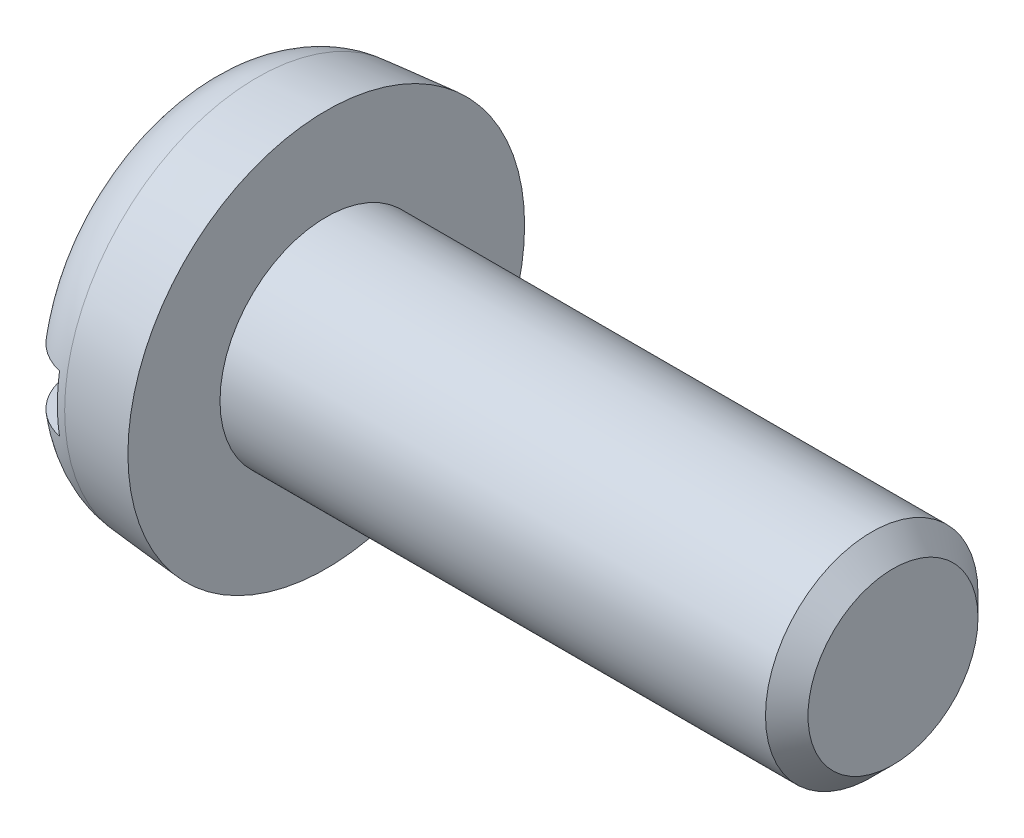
ISO-10303-21;
HEADER;
FILE_DESCRIPTION(('STEP AP214'),'2;1');
FILE_NAME('part.step','',(''),(''),'','','');
FILE_SCHEMA(('AUTOMOTIVE_DESIGN { 1 0 10303 214 1 1 1 1 }'));
ENDSEC;
DATA;
#1=APPLICATION_CONTEXT('core data for automotive mechanical design processes');
#2=APPLICATION_PROTOCOL_DEFINITION('international standard','automotive_design',2000,#1);
#3=PRODUCT_CONTEXT('',#1,'mechanical');
#4=PRODUCT('Part','Part','',(#3));
#5=PRODUCT_RELATED_PRODUCT_CATEGORY('part','',(#4));
#6=PRODUCT_DEFINITION_FORMATION('','',#4);
#7=PRODUCT_DEFINITION_CONTEXT('part definition',#1,'design');
#8=PRODUCT_DEFINITION('design','',#6,#7);
#9=PRODUCT_DEFINITION_SHAPE('','',#8);
#10=(LENGTH_UNIT() NAMED_UNIT(*) SI_UNIT(.MILLI.,.METRE.));
#11=(NAMED_UNIT(*) PLANE_ANGLE_UNIT() SI_UNIT($,.RADIAN.));
#12=(NAMED_UNIT(*) SI_UNIT($,.STERADIAN.) SOLID_ANGLE_UNIT());
#13=UNCERTAINTY_MEASURE_WITH_UNIT(LENGTH_MEASURE(1.E-05),#10,'distance_accuracy_value','');
#14=(GEOMETRIC_REPRESENTATION_CONTEXT(3) GLOBAL_UNCERTAINTY_ASSIGNED_CONTEXT((#13)) GLOBAL_UNIT_ASSIGNED_CONTEXT((#10,
#11,#12)) REPRESENTATION_CONTEXT('',''));
#15=CARTESIAN_POINT('',(0.,0.,0.));
#16=DIRECTION('',(0.,0.,1.));
#17=DIRECTION('',(1.,0.,0.));
#18=AXIS2_PLACEMENT_3D('',#15,#16,#17);
#19=CARTESIAN_POINT('',(0.,0.,0.));
#20=DIRECTION('',(-1.,0.,0.));
#21=DIRECTION('',(0.,0.,1.));
#22=AXIS2_PLACEMENT_3D('',#19,#20,#21);
#23=PLANE('',#22);
#24=DIRECTION('',(0.,0.,-1.));
#25=VECTOR('',#24,1.);
#26=CARTESIAN_POINT('',(0.,0.399999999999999,2.8));
#27=LINE('',#26,#25);
#28=CARTESIAN_POINT('',(0.,0.399999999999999,1.77326763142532));
#29=VERTEX_POINT('',#28);
#30=CARTESIAN_POINT('',(0.,0.399999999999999,-1.77326763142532));
#31=VERTEX_POINT('',#30);
#32=EDGE_CURVE('E84',#29,#31,#27,.T.);
#33=ORIENTED_EDGE('',*,*,#32,.F.);
#34=CARTESIAN_POINT('',(0.,0.,0.));
#35=DIRECTION('',(-1.,0.,0.));
#36=DIRECTION('',(0.,0.,1.));
#37=AXIS2_PLACEMENT_3D('',#34,#35,#36);
#38=CIRCLE('',#37,1.81782234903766);
#39=EDGE_CURVE('E91',#29,#31,#38,.T.);
#40=ORIENTED_EDGE('',*,*,#39,.T.);
#41=EDGE_LOOP('',(#33,#40));
#42=FACE_BOUND('',#41,.T.);
#43=ADVANCED_FACE('F31',(#42),#23,.T.);
#44=CARTESIAN_POINT('',(-25.4,0.,0.));
#45=DIRECTION('',(-1.,0.,0.));
#46=DIRECTION('',(0.,0.,1.));
#47=AXIS2_PLACEMENT_3D('',#44,#45,#46);
#48=CYLINDRICAL_SURFACE('',#47,1.5);
#49=CARTESIAN_POINT('',(9.49999999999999,0.,0.));
#50=DIRECTION('',(1.,0.,0.));
#51=DIRECTION('',(0.,0.,-1.));
#52=AXIS2_PLACEMENT_3D('',#49,#50,#51);
#53=CIRCLE('',#52,1.5);
#54=CARTESIAN_POINT('',(9.49999999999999,0.,-1.5));
#55=VERTEX_POINT('',#54);
#56=EDGE_CURVE('E39',#55,#55,#53,.F.);
#57=ORIENTED_EDGE('',*,*,#56,.T.);
#58=EDGE_LOOP('',(#57));
#59=FACE_BOUND('',#58,.T.);
#60=CARTESIAN_POINT('',(1.8,0.,0.));
#61=DIRECTION('',(-1.,0.,0.));
#62=DIRECTION('',(0.,0.,1.));
#63=AXIS2_PLACEMENT_3D('',#60,#61,#62);
#64=CIRCLE('',#63,1.5);
#65=CARTESIAN_POINT('',(1.8,0.,1.5));
#66=VERTEX_POINT('',#65);
#67=EDGE_CURVE('E97',#66,#66,#64,.T.);
#68=ORIENTED_EDGE('',*,*,#67,.F.);
#69=EDGE_LOOP('',(#68));
#70=FACE_BOUND('',#69,.T.);
#71=ADVANCED_FACE('F33',(#59,#70),#48,.T.);
#72=CARTESIAN_POINT('',(9.8,1.5,0.));
#73=DIRECTION('',(1.,0.,0.));
#74=DIRECTION('',(0.,0.,-1.));
#75=AXIS2_PLACEMENT_3D('',#72,#73,#74);
#76=PLANE('',#75);
#77=CARTESIAN_POINT('',(9.8,0.,0.));
#78=DIRECTION('',(1.,0.,0.));
#79=DIRECTION('',(0.,0.,-1.));
#80=AXIS2_PLACEMENT_3D('',#77,#78,#79);
#81=CIRCLE('',#80,1.19999999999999);
#82=CARTESIAN_POINT('',(9.8,0.,-1.19999999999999));
#83=VERTEX_POINT('',#82);
#84=EDGE_CURVE('E11',#83,#83,#81,.T.);
#85=ORIENTED_EDGE('',*,*,#84,.T.);
#86=EDGE_LOOP('',(#85));
#87=FACE_BOUND('',#86,.T.);
#88=ADVANCED_FACE('F147',(#87),#76,.T.);
#89=DIRECTION('',(0.,0.,1.));
#90=VECTOR('',#89,1.);
#91=CARTESIAN_POINT('',(0.,-0.4,-2.8));
#92=LINE('',#91,#90);
#93=CARTESIAN_POINT('',(0.,-0.4,-1.77326763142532));
#94=VERTEX_POINT('',#93);
#95=CARTESIAN_POINT('',(0.,-0.4,1.77326763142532));
#96=VERTEX_POINT('',#95);
#97=EDGE_CURVE('E73',#94,#96,#92,.T.);
#98=ORIENTED_EDGE('',*,*,#97,.F.);
#99=EDGE_CURVE('E82',#94,#96,#38,.T.);
#100=ORIENTED_EDGE('',*,*,#99,.T.);
#101=EDGE_LOOP('',(#98,#100));
#102=FACE_BOUND('',#101,.T.);
#103=ADVANCED_FACE('F81',(#102),#23,.T.);
#104=CARTESIAN_POINT('',(0.,0.,0.));
#105=DIRECTION('',(1.,0.,0.));
#106=DIRECTION('',(0.,0.,-1.));
#107=AXIS2_PLACEMENT_3D('',#104,#105,#106);
#108=CONICAL_SURFACE('',#107,2.64252040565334,0.087266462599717);
#109=CARTESIAN_POINT('',(0.821559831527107,0.,0.));
#110=DIRECTION('',(-1.,0.,0.));
#111=DIRECTION('',(0.,0.,1.));
#112=AXIS2_PLACEMENT_3D('',#109,#110,#111);
#113=CIRCLE('',#112,2.71439757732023);
#114=CARTESIAN_POINT('',(0.821559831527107,0.,2.71439757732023));
#115=VERTEX_POINT('',#114);
#116=EDGE_CURVE('E95',#115,#115,#113,.F.);
#117=ORIENTED_EDGE('',*,*,#116,.T.);
#118=EDGE_LOOP('',(#117));
#119=FACE_BOUND('',#118,.T.);
#120=CARTESIAN_POINT('',(1.8,0.,0.));
#121=DIRECTION('',(-1.,0.,0.));
#122=DIRECTION('',(0.,0.,1.));
#123=AXIS2_PLACEMENT_3D('',#120,#121,#122);
#124=CIRCLE('',#123,2.8);
#125=CARTESIAN_POINT('',(1.8,0.,2.8));
#126=VERTEX_POINT('',#125);
#127=EDGE_CURVE('E92',#126,#126,#124,.T.);
#128=ORIENTED_EDGE('',*,*,#127,.T.);
#129=EDGE_LOOP('',(#128));
#130=FACE_BOUND('',#129,.T.);
#131=ADVANCED_FACE('F151',(#119,#130),#108,.T.);
#132=CARTESIAN_POINT('',(1.8,1.5,0.));
#133=DIRECTION('',(-1.,0.,0.));
#134=DIRECTION('',(0.,0.,1.));
#135=AXIS2_PLACEMENT_3D('',#132,#133,#134);
#136=PLANE('',#135);
#137=ORIENTED_EDGE('',*,*,#127,.F.);
#138=EDGE_LOOP('',(#137));
#139=FACE_BOUND('',#138,.T.);
#140=ORIENTED_EDGE('',*,*,#67,.T.);
#141=EDGE_LOOP('',(#140));
#142=FACE_BOUND('',#141,.T.);
#143=ADVANCED_FACE('F156',(#139,#142),#136,.F.);
#144=CARTESIAN_POINT('',(0.9,0.,0.));
#145=DIRECTION('',(-1.,0.,0.));
#146=DIRECTION('',(0.,0.,1.));
#147=AXIS2_PLACEMENT_3D('',#144,#145,#146);
#148=TOROIDAL_SURFACE('',#147,1.81782234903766,0.9);
#149=CARTESIAN_POINT('',(0.285780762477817,0.399999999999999,-2.44311963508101));
#150=CARTESIAN_POINT('',(0.322325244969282,0.399999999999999,-2.47769297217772));
#151=CARTESIAN_POINT('',(0.361794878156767,0.399999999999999,-2.50922544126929));
#152=CARTESIAN_POINT('',(0.445493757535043,0.399999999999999,-2.56525291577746));
#153=CARTESIAN_POINT('',(0.48972822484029,0.399999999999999,-2.58974009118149));
#154=CARTESIAN_POINT('',(0.581685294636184,0.399999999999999,-2.63091846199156));
#155=CARTESIAN_POINT('',(0.629407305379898,0.399999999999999,-2.64761097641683));
#156=CARTESIAN_POINT('',(0.726972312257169,0.399999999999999,-2.67270033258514));
#157=CARTESIAN_POINT('',(0.776814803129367,0.399999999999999,-2.68109913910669));
#158=CARTESIAN_POINT('',(0.876977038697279,0.399999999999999,-2.68933922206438));
#159=CARTESIAN_POINT('',(0.92729364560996,0.399999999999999,-2.68921866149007));
#160=CARTESIAN_POINT('',(1.02719093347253,0.399999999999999,-2.68051830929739));
#161=CARTESIAN_POINT('',(1.07677160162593,0.399999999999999,-2.67193837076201));
#162=CARTESIAN_POINT('',(1.17371760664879,0.399999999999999,-2.6465919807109));
#163=CARTESIAN_POINT('',(1.22108599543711,0.399999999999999,-2.62983719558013));
#164=CARTESIAN_POINT('',(1.31235127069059,0.399999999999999,-2.58864040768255));
#165=CARTESIAN_POINT('',(1.35624813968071,0.399999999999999,-2.56419836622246));
#166=CARTESIAN_POINT('',(1.43950339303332,0.399999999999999,-2.50824069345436));
#167=CARTESIAN_POINT('',(1.47884484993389,0.399999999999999,-2.47669988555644));
#168=CARTESIAN_POINT('',(1.55173067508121,0.399999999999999,-2.40751412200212));
#169=CARTESIAN_POINT('',(1.5852748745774,0.399999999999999,-2.36986898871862));
#170=CARTESIAN_POINT('',(1.64594872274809,0.399999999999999,-2.28919528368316));
#171=CARTESIAN_POINT('',(1.67301846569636,0.399999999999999,-2.24612167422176));
#172=CARTESIAN_POINT('',(1.71966197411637,0.399999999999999,-2.15609376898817));
#173=CARTESIAN_POINT('',(1.73923530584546,0.399999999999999,-2.10913924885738));
#174=CARTESIAN_POINT('',(1.77066025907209,0.399999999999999,-2.01194193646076));
#175=CARTESIAN_POINT('',(1.78239254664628,0.399999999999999,-1.96166058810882));
#176=CARTESIAN_POINT('',(1.7974373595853,0.399999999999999,-1.85985639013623));
#177=CARTESIAN_POINT('',(1.80074908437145,0.399999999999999,-1.80833342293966));
#178=CARTESIAN_POINT('',(1.79894832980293,0.399999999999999,-1.70434405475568));
#179=CARTESIAN_POINT('',(1.79365584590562,0.399999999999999,-1.651880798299));
#180=CARTESIAN_POINT('',(1.77456092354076,0.399999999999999,-1.54852841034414));
#181=CARTESIAN_POINT('',(1.76075741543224,0.399999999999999,-1.49763947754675));
#182=CARTESIAN_POINT('',(1.7246504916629,0.399999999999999,-1.3975266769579));
#183=CARTESIAN_POINT('',(1.70214283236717,0.399999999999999,-1.34837644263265));
#184=CARTESIAN_POINT('',(1.64933120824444,0.399999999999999,-1.25444995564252));
#185=CARTESIAN_POINT('',(1.6190255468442,0.399999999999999,-1.20967465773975));
#186=CARTESIAN_POINT('',(1.55085214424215,0.399999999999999,-1.12504927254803));
#187=CARTESIAN_POINT('',(1.51286662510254,0.399999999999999,-1.08529386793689));
#188=CARTESIAN_POINT('',(1.4306134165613,0.399999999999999,-1.01288372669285));
#189=CARTESIAN_POINT('',(1.38634513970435,0.399999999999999,-0.980229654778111));
#190=CARTESIAN_POINT('',(1.29378824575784,0.399999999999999,-0.924048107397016));
#191=CARTESIAN_POINT('',(1.24562231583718,0.399999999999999,-0.900319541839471));
#192=CARTESIAN_POINT('',(1.14574424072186,0.399999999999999,-0.862177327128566));
#193=CARTESIAN_POINT('',(1.09403573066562,0.399999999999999,-0.847754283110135));
#194=CARTESIAN_POINT('',(0.993395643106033,0.399999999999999,-0.830011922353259));
#195=CARTESIAN_POINT('',(0.944615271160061,0.399999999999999,-0.825833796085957));
#196=CARTESIAN_POINT('',(0.847107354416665,0.399999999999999,-0.826334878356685));
#197=CARTESIAN_POINT('',(0.798379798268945,0.399999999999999,-0.831011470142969));
#198=CARTESIAN_POINT('',(0.705495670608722,0.399999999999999,-0.848340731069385));
#199=CARTESIAN_POINT('',(0.661242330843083,0.399999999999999,-0.860484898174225));
#200=CARTESIAN_POINT('',(0.575232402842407,0.399999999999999,-0.891650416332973));
#201=CARTESIAN_POINT('',(0.533476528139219,0.399999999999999,-0.910673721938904));
#202=CARTESIAN_POINT('',(0.451191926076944,0.399999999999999,-0.956010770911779));
#203=CARTESIAN_POINT('',(0.41084895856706,0.399999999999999,-0.982660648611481));
#204=CARTESIAN_POINT('',(0.334722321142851,0.399999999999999,-1.04182188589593));
#205=CARTESIAN_POINT('',(0.298940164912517,0.399999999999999,-1.0743351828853));
#206=CARTESIAN_POINT('',(0.229649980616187,0.399999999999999,-1.14749226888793));
#207=CARTESIAN_POINT('',(0.196634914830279,0.399999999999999,-1.18860403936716));
#208=CARTESIAN_POINT('',(0.137645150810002,0.399999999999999,-1.27560624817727));
#209=CARTESIAN_POINT('',(0.111672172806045,0.399999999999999,-1.32149785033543));
#210=CARTESIAN_POINT('',(0.0665593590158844,0.399999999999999,-1.41881690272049));
#211=CARTESIAN_POINT('',(0.0477401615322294,0.399999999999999,-1.47039354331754));
#212=CARTESIAN_POINT('',(0.0191028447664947,0.399999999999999,-1.57598967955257));
#213=CARTESIAN_POINT('',(0.0092842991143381,0.399999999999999,-1.63000905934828));
#214=CARTESIAN_POINT('',(-0.000908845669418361,0.399999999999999,-1.73850050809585));
#215=CARTESIAN_POINT('',(-0.00135843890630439,0.399999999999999,-1.7929654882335));
#216=CARTESIAN_POINT('',(0.00713794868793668,0.399999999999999,-1.90117587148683));
#217=CARTESIAN_POINT('',(0.0160852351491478,0.399999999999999,-1.9549211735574));
#218=CARTESIAN_POINT('',(0.0428869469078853,0.399999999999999,-2.05874477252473));
#219=CARTESIAN_POINT('',(0.0605196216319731,0.399999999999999,-2.10888044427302));
#220=CARTESIAN_POINT('',(0.104140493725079,0.399999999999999,-2.20532358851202));
#221=CARTESIAN_POINT('',(0.130117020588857,0.399999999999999,-2.25163629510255));
#222=CARTESIAN_POINT('',(0.178150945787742,0.399999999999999,-2.32211375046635));
#223=CARTESIAN_POINT('',(0.197843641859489,0.399999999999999,-2.34792122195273));
#224=CARTESIAN_POINT('',(0.239879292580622,0.399999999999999,-2.39728022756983));
#225=CARTESIAN_POINT('',(0.26222221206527,0.399999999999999,-2.42083179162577));
#226=CARTESIAN_POINT('',(0.285780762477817,0.399999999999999,-2.44311963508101));
#227=B_SPLINE_CURVE_WITH_KNOTS('',3,(#149,#150,#151,#152,#153,#154,#155,#156,#157,#158,#159,
#160,#161,#162,#163,#164,#165,#166,#167,#168,#169,#170,#171,#172,#173,#174,#175,#176,#177,#178,
#179,#180,#181,#182,#183,#184,#185,#186,#187,#188,#189,#190,#191,#192,#193,#194,#195,#196,#197,
#198,#199,#200,#201,#202,#203,#204,#205,#206,#207,#208,#209,#210,#211,#212,#213,#214,#215,#216,
#217,#218,#219,#220,#221,#222,#223,#224,#225,#226),.UNSPECIFIED.,.T.,.F.,(4,2,2,2,2,2,2,2,2,2,2,
2,2,2,2,2,2,2,2,2,2,2,2,2,2,2,2,2,2,2,2,2,2,2,2,2,2,2,4),(0.,0.15080428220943,0.301775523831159,
0.452721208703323,0.603631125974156,0.753865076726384,0.904101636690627,1.05412441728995,
1.2041479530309,1.35471219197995,1.50528081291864,1.65719291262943,1.80911380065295,
1.96329712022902,2.11749509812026,2.27496068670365,2.43244606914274,2.59387611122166,
2.75534130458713,2.9195015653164,3.08367718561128,3.24389389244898,3.40394859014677,
3.55004213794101,3.69609251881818,3.83315592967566,3.97025831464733,4.11470991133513,
4.25920932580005,4.41668805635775,4.57420522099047,4.73812462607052,4.90203626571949,
5.06463536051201,5.22725705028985,5.38592661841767,5.54437521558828,5.64159310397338,
5.73880970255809),.UNSPECIFIED.);
#228=CARTESIAN_POINT('',(0.7,0.399999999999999,-2.66547244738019));
#229=VERTEX_POINT('',#228);
#230=EDGE_CURVE('E77',#31,#229,#227,.T.);
#231=ORIENTED_EDGE('',*,*,#230,.F.);
#232=ORIENTED_EDGE('',*,*,#39,.F.);
#233=CARTESIAN_POINT('',(0.356169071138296,0.399999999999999,1.02545886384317));
#234=CARTESIAN_POINT('',(0.394477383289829,0.399999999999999,0.994276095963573));
#235=CARTESIAN_POINT('',(0.435252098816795,0.399999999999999,0.966090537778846));
#236=CARTESIAN_POINT('',(0.520874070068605,0.399999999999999,0.916713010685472));
#237=CARTESIAN_POINT('',(0.56572297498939,0.399999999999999,0.895523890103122));
#238=CARTESIAN_POINT('',(0.658585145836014,0.399999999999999,0.861072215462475));
#239=CARTESIAN_POINT('',(0.706609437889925,0.399999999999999,0.84783908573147));
#240=CARTESIAN_POINT('',(0.80424325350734,0.399999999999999,0.83024223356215));
#241=CARTESIAN_POINT('',(0.85385162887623,0.399999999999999,0.825872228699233));
#242=CARTESIAN_POINT('',(0.950010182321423,0.399999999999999,0.826277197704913));
#243=CARTESIAN_POINT('',(0.99656347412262,0.399999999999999,0.830513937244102));
#244=CARTESIAN_POINT('',(1.08828168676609,0.399999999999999,0.846797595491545));
#245=CARTESIAN_POINT('',(1.1334463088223,0.399999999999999,0.858846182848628));
#246=CARTESIAN_POINT('',(1.22099947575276,0.399999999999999,0.890027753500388));
#247=CARTESIAN_POINT('',(1.26339999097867,0.399999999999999,0.909127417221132));
#248=CARTESIAN_POINT('',(1.34475562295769,0.399999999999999,0.953613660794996));
#249=CARTESIAN_POINT('',(1.38370973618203,0.399999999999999,0.979002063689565));
#250=CARTESIAN_POINT('',(1.4606297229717,0.399999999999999,1.03768873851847));
#251=CARTESIAN_POINT('',(1.49821861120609,0.399999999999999,1.07148126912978));
#252=CARTESIAN_POINT('',(1.56766557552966,0.399999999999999,1.14451739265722));
#253=CARTESIAN_POINT('',(1.59952174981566,0.399999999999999,1.18376278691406));
#254=CARTESIAN_POINT('',(1.65882951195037,0.399999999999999,1.26965174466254));
#255=CARTESIAN_POINT('',(1.68580874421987,0.399999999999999,1.3166225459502));
#256=CARTESIAN_POINT('',(1.7316261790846,0.399999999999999,1.41438438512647));
#257=CARTESIAN_POINT('',(1.7504634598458,0.399999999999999,1.46517585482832));
#258=CARTESIAN_POINT('',(1.77959171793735,0.399999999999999,1.56990546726));
#259=CARTESIAN_POINT('',(1.78976336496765,0.399999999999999,1.62387693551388));
#260=CARTESIAN_POINT('',(1.80070617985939,0.399999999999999,1.73276786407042));
#261=CARTESIAN_POINT('',(1.80147810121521,0.399999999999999,1.78768724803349));
#262=CARTESIAN_POINT('',(1.7935515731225,0.399999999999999,1.89576039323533));
#263=CARTESIAN_POINT('',(1.78503812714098,0.399999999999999,1.94892767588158));
#264=CARTESIAN_POINT('',(1.75897009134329,0.399999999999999,2.05299963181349));
#265=CARTESIAN_POINT('',(1.74141670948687,0.399999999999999,2.10390460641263));
#266=CARTESIAN_POINT('',(1.69825810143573,0.399999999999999,2.20064023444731));
#267=CARTESIAN_POINT('',(1.67286703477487,0.399999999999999,2.24656646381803));
#268=CARTESIAN_POINT('',(1.61458416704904,0.399999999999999,2.33338474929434));
#269=CARTESIAN_POINT('',(1.58169323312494,0.399999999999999,2.37427738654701));
#270=CARTESIAN_POINT('',(1.51007060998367,0.399999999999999,2.44900649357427));
#271=CARTESIAN_POINT('',(1.47146964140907,0.399999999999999,2.48296829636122));
#272=CARTESIAN_POINT('',(1.38904817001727,0.399999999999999,2.54382334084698));
#273=CARTESIAN_POINT('',(1.34522808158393,0.399999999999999,2.57071714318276));
#274=CARTESIAN_POINT('',(1.25424836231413,0.399999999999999,2.61630908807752));
#275=CARTESIAN_POINT('',(1.20714119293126,0.399999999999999,2.63511196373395));
#276=CARTESIAN_POINT('',(1.11042474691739,0.399999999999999,2.66447616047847));
#277=CARTESIAN_POINT('',(1.06081558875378,0.399999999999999,2.67503787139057));
#278=CARTESIAN_POINT('',(0.960893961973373,0.399999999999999,2.68755622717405));
#279=CARTESIAN_POINT('',(0.910589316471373,0.399999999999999,2.68957539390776));
#280=CARTESIAN_POINT('',(0.810358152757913,0.399999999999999,2.68512046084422));
#281=CARTESIAN_POINT('',(0.760431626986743,0.399999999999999,2.67864653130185));
#282=CARTESIAN_POINT('',(0.662478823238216,0.399999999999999,2.65741995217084));
#283=CARTESIAN_POINT('',(0.614448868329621,0.399999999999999,2.64268425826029));
#284=CARTESIAN_POINT('',(0.521534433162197,0.399999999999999,2.60538142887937));
#285=CARTESIAN_POINT('',(0.476649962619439,0.399999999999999,2.58281426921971));
#286=CARTESIAN_POINT('',(0.391148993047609,0.399999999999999,2.53043182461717));
#287=CARTESIAN_POINT('',(0.350545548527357,0.399999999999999,2.50059523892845));
#288=CARTESIAN_POINT('',(0.27487411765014,0.399999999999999,2.43457977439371));
#289=CARTESIAN_POINT('',(0.239806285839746,0.399999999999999,2.39840071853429));
#290=CARTESIAN_POINT('',(0.175879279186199,0.399999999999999,2.32042102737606));
#291=CARTESIAN_POINT('',(0.147073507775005,0.399999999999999,2.27857662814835));
#292=CARTESIAN_POINT('',(0.0967847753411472,0.399999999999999,2.19069995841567));
#293=CARTESIAN_POINT('',(0.0753022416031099,0.399999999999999,2.14466744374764));
#294=CARTESIAN_POINT('',(0.0399276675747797,0.399999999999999,2.04903409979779));
#295=CARTESIAN_POINT('',(0.0261471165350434,0.399999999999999,1.99939205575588));
#296=CARTESIAN_POINT('',(0.00693602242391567,0.399999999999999,1.89852251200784));
#297=CARTESIAN_POINT('',(0.00150590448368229,0.399999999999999,1.84729493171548));
#298=CARTESIAN_POINT('',(-0.000985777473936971,0.399999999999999,1.74359522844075));
#299=CARTESIAN_POINT('',(0.00212519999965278,0.399999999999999,1.69111899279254));
#300=CARTESIAN_POINT('',(0.0168916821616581,0.399999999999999,1.58737297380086));
#301=CARTESIAN_POINT('',(0.028549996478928,0.399999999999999,1.53610359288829));
#302=CARTESIAN_POINT('',(0.0604020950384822,0.399999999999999,1.43486374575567));
#303=CARTESIAN_POINT('',(0.0808043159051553,0.399999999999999,1.38495893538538));
#304=CARTESIAN_POINT('',(0.129530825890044,0.399999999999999,1.28921347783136));
#305=CARTESIAN_POINT('',(0.157849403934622,0.399999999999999,1.24336993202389));
#306=CARTESIAN_POINT('',(0.213684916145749,0.399999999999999,1.16773658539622));
#307=CARTESIAN_POINT('',(0.239651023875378,0.399999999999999,1.13678903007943));
#308=CARTESIAN_POINT('',(0.29525297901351,0.399999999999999,1.07838116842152));
#309=CARTESIAN_POINT('',(0.324888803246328,0.399999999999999,1.05092084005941));
#310=CARTESIAN_POINT('',(0.356169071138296,0.399999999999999,1.02545886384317));
#311=B_SPLINE_CURVE_WITH_KNOTS('',3,(#233,#234,#235,#236,#237,#238,#239,#240,#241,#242,#243,
#244,#245,#246,#247,#248,#249,#250,#251,#252,#253,#254,#255,#256,#257,#258,#259,#260,#261,#262,
#263,#264,#265,#266,#267,#268,#269,#270,#271,#272,#273,#274,#275,#276,#277,#278,#279,#280,#281,
#282,#283,#284,#285,#286,#287,#288,#289,#290,#291,#292,#293,#294,#295,#296,#297,#298,#299,#300,
#301,#302,#303,#304,#305,#306,#307,#308,#309,#310),.UNSPECIFIED.,.T.,.F.,(4,2,2,2,2,2,2,2,2,2,2,
2,2,2,2,2,2,2,2,2,2,2,2,2,2,2,2,2,2,2,2,2,2,2,2,2,2,2,4),(0.,0.148056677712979,
0.296173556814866,0.444834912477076,0.593390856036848,0.732942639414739,0.87252424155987,
1.01145452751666,1.15042513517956,1.30141738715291,1.45245963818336,1.61420969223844,
1.7759780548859,1.93993961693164,2.10388803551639,2.26462860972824,2.42534771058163,
2.58201478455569,2.73866375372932,2.89216335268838,3.04565077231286,3.19708679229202,
3.34851564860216,3.49883427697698,3.64914989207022,3.79915813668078,3.94916684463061,
4.09962050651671,4.25007836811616,4.40177296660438,4.55347641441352,4.70732244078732,
4.8611762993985,5.01816095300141,5.17519723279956,5.33620557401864,5.49709805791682,
5.61799301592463,5.73888721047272),.UNSPECIFIED.);
#312=CARTESIAN_POINT('',(0.7,0.399999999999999,2.66547244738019));
#313=VERTEX_POINT('',#312);
#314=EDGE_CURVE('E110',#313,#29,#311,.T.);
#315=ORIENTED_EDGE('',*,*,#314,.F.);
#316=CARTESIAN_POINT('',(0.7,0.,0.));
#317=DIRECTION('',(-1.,0.,0.));
#318=DIRECTION('',(0.,0.,1.));
#319=AXIS2_PLACEMENT_3D('',#316,#317,#318);
#320=CIRCLE('',#319,2.69531878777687);
#321=CARTESIAN_POINT('',(0.7,-0.4,2.66547244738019));
#322=VERTEX_POINT('',#321);
#323=EDGE_CURVE('E103',#313,#322,#320,.F.);
#324=ORIENTED_EDGE('',*,*,#323,.T.);
#325=CARTESIAN_POINT('',(0.356169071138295,-0.4,1.02545886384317));
#326=CARTESIAN_POINT('',(0.314031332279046,-0.4,1.05976167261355));
#327=CARTESIAN_POINT('',(0.274819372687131,-0.4,1.0977427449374));
#328=CARTESIAN_POINT('',(0.203268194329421,-0.4,1.17978565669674));
#329=CARTESIAN_POINT('',(0.170942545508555,-0.4,1.22385922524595));
#330=CARTESIAN_POINT('',(0.114111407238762,-0.4,1.31672727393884));
#331=CARTESIAN_POINT('',(0.0895968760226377,-0.4,1.36551620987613));
#332=CARTESIAN_POINT('',(0.0490785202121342,-0.4,1.46648183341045));
#333=CARTESIAN_POINT('',(0.0330703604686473,-0.4,1.51865678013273));
#334=CARTESIAN_POINT('',(0.0100453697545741,-0.4,1.62518908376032));
#335=CARTESIAN_POINT('',(0.00306618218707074,-0.4,1.67955460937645));
#336=CARTESIAN_POINT('',(-0.00144685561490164,-0.4,1.78868546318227));
#337=CARTESIAN_POINT('',(0.00101939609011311,-0.4,1.84345079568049));
#338=CARTESIAN_POINT('',(0.015289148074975,-0.4,1.9505233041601));
#339=CARTESIAN_POINT('',(0.02688549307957,-0.4,2.0028580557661));
#340=CARTESIAN_POINT('',(0.0589248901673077,-0.4,2.10474672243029));
#341=CARTESIAN_POINT('',(0.0793666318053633,-0.4,2.15430104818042));
#342=CARTESIAN_POINT('',(0.12795627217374,-0.4,2.24792186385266));
#343=CARTESIAN_POINT('',(0.155901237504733,-0.4,2.29209371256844));
#344=CARTESIAN_POINT('',(0.218944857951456,-0.4,2.37499861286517));
#345=CARTESIAN_POINT('',(0.254042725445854,-0.4,2.41373226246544));
#346=CARTESIAN_POINT('',(0.32966685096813,-0.4,2.48389534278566));
#347=CARTESIAN_POINT('',(0.370077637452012,-0.4,2.51544927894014));
#348=CARTESIAN_POINT('',(0.455677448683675,-0.4,2.57122459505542));
#349=CARTESIAN_POINT('',(0.500866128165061,-0.4,2.59544650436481));
#350=CARTESIAN_POINT('',(0.59413782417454,-0.4,2.6355729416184));
#351=CARTESIAN_POINT('',(0.642178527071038,-0.4,2.65157587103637));
#352=CARTESIAN_POINT('',(0.740273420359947,-0.4,2.67523109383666));
#353=CARTESIAN_POINT('',(0.790327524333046,-0.4,2.68288374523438));
#354=CARTESIAN_POINT('',(0.890686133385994,-0.4,2.68958762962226));
#355=CARTESIAN_POINT('',(0.940986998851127,-0.4,2.68869347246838));
#356=CARTESIAN_POINT('',(1.04072178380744,-0.4,2.67846167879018));
#357=CARTESIAN_POINT('',(1.0901557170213,-0.4,2.66912417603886));
#358=CARTESIAN_POINT('',(1.18669599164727,-0.4,2.64229877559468));
#359=CARTESIAN_POINT('',(1.23380501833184,-0.4,2.6248205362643));
#360=CARTESIAN_POINT('',(1.32443528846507,-0.4,2.58223220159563));
#361=CARTESIAN_POINT('',(1.36795650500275,-0.4,2.5571220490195));
#362=CARTESIAN_POINT('',(1.45036421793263,-0.4,2.49989362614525));
#363=CARTESIAN_POINT('',(1.48923230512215,-0.4,2.46774885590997));
#364=CARTESIAN_POINT('',(1.56107927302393,-0.4,2.39744378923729));
#365=CARTESIAN_POINT('',(1.59405796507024,-0.4,2.35928330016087));
#366=CARTESIAN_POINT('',(1.65352847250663,-0.4,2.2776666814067));
#367=CARTESIAN_POINT('',(1.67995797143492,-0.4,2.23416516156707));
#368=CARTESIAN_POINT('',(1.72526137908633,-0.4,2.14339421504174));
#369=CARTESIAN_POINT('',(1.74413484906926,-0.4,2.09612456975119));
#370=CARTESIAN_POINT('',(1.77411508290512,-0.4,1.9983989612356));
#371=CARTESIAN_POINT('',(1.78509960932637,-0.4,1.9479055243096));
#372=CARTESIAN_POINT('',(1.79862667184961,-0.4,1.84580292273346));
#373=CARTESIAN_POINT('',(1.80116838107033,-0.4,1.79419364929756));
#374=CARTESIAN_POINT('',(1.79780993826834,-0.4,1.69014314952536));
#375=CARTESIAN_POINT('',(1.79172746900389,-0.4,1.63770783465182));
#376=CARTESIAN_POINT('',(1.77106806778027,-0.4,1.53454005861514));
#377=CARTESIAN_POINT('',(1.75649007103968,-0.4,1.48380781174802));
#378=CARTESIAN_POINT('',(1.7188487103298,-0.4,1.38413781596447));
#379=CARTESIAN_POINT('',(1.69558194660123,-0.4,1.33527684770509));
#380=CARTESIAN_POINT('',(1.64130257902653,-0.4,1.24205401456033));
#381=CARTESIAN_POINT('',(1.6102882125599,-0.4,1.19769317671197));
#382=CARTESIAN_POINT('',(1.54078360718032,-0.4,1.11407031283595));
#383=CARTESIAN_POINT('',(1.50218355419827,-0.4,1.07489936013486));
#384=CARTESIAN_POINT('',(1.418793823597,-0.4,1.00377929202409));
#385=CARTESIAN_POINT('',(1.37400377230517,-0.4,0.971830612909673));
#386=CARTESIAN_POINT('',(1.28066227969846,-0.4,0.917245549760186));
#387=CARTESIAN_POINT('',(1.23224470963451,-0.4,0.894381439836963));
#388=CARTESIAN_POINT('',(1.13202516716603,-0.4,0.858023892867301));
#389=CARTESIAN_POINT('',(1.08022692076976,-0.4,0.844520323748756));
#390=CARTESIAN_POINT('',(0.979686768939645,-0.4,0.828554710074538));
#391=CARTESIAN_POINT('',(0.93108358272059,-0.4,0.82521631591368));
#392=CARTESIAN_POINT('',(0.834057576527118,-0.4,0.827306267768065));
#393=CARTESIAN_POINT('',(0.785634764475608,-0.4,0.832734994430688));
#394=CARTESIAN_POINT('',(0.693219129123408,-0.4,0.851440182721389));
#395=CARTESIAN_POINT('',(0.649130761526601,-0.4,0.864254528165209));
#396=CARTESIAN_POINT('',(0.563580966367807,-0.4,0.896690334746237));
#397=CARTESIAN_POINT('',(0.522117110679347,-0.4,0.916305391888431));
#398=CARTESIAN_POINT('',(0.460201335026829,-0.4,0.951554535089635));
#399=CARTESIAN_POINT('',(0.438547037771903,-0.4,0.965129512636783));
#400=CARTESIAN_POINT('',(0.396436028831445,-0.4,0.994018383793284));
#401=CARTESIAN_POINT('',(0.375979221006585,-0.4,1.00933213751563));
#402=CARTESIAN_POINT('',(0.356169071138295,-0.4,1.02545886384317));
#403=B_SPLINE_CURVE_WITH_KNOTS('',3,(#325,#326,#327,#328,#329,#330,#331,#332,#333,#334,#335,
#336,#337,#338,#339,#340,#341,#342,#343,#344,#345,#346,#347,#348,#349,#350,#351,#352,#353,#354,
#355,#356,#357,#358,#359,#360,#361,#362,#363,#364,#365,#366,#367,#368,#369,#370,#371,#372,#373,
#374,#375,#376,#377,#378,#379,#380,#381,#382,#383,#384,#385,#386,#387,#388,#389,#390,#391,#392,
#393,#394,#395,#396,#397,#398,#399,#400,#401,#402),.UNSPECIFIED.,.T.,.F.,(4,2,2,2,2,2,2,2,2,2,2,
2,2,2,2,2,2,2,2,2,2,2,2,2,2,2,2,2,2,2,2,2,2,2,2,2,2,2,4),(0.,0.162908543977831,
0.326135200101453,0.489172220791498,0.652126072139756,0.815757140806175,0.979389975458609,
1.13941349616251,1.29941331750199,1.45545894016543,1.61148738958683,1.76455910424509,
1.91761976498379,2.068802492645,2.21997873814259,2.37018969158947,2.52039826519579,
2.67042907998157,2.82046101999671,2.97106818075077,3.12168016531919,3.27367450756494,
3.42567767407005,3.5799880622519,3.73431356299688,3.89195060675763,4.04960741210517,
4.2112132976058,4.37285598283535,4.53703863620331,4.70123120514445,4.86099956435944,
5.02059471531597,5.16597452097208,5.31136063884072,5.44850857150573,5.58552770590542,
5.66212180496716,5.73870974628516),.UNSPECIFIED.);
#404=EDGE_CURVE('E90',#96,#322,#403,.T.);
#405=ORIENTED_EDGE('',*,*,#404,.F.);
#406=ORIENTED_EDGE('',*,*,#99,.F.);
#407=CARTESIAN_POINT('',(0.285780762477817,-0.4,-2.44311963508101));
#408=CARTESIAN_POINT('',(0.248557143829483,-0.4,-2.4078972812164));
#409=CARTESIAN_POINT('',(0.214312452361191,-0.4,-2.3694650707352));
#410=CARTESIAN_POINT('',(0.152768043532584,-0.4,-2.28733938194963));
#411=CARTESIAN_POINT('',(0.125478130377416,-0.4,-2.24363860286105));
#412=CARTESIAN_POINT('',(0.0786257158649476,-0.4,-2.15234079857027));
#413=CARTESIAN_POINT('',(0.0590537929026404,-0.4,-2.10474861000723));
#414=CARTESIAN_POINT('',(0.0280650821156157,-0.4,-2.00700047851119));
#415=CARTESIAN_POINT('',(0.0166461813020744,-0.4,-1.95684520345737));
#416=CARTESIAN_POINT('',(0.00206923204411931,-0.4,-1.85464080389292));
#417=CARTESIAN_POINT('',(-0.000972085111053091,-0.4,-1.80257506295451));
#418=CARTESIAN_POINT('',(0.00151453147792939,-0.4,-1.69864852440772));
#419=CARTESIAN_POINT('',(0.007043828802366,-0.4,-1.64678776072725));
#420=CARTESIAN_POINT('',(0.0266516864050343,-0.4,-1.5434240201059));
#421=CARTESIAN_POINT('',(0.0409314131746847,-0.4,-1.49195921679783));
#422=CARTESIAN_POINT('',(0.0777275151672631,-0.4,-1.39206285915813));
#423=CARTESIAN_POINT('',(0.100245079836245,-0.4,-1.34363174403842));
#424=CARTESIAN_POINT('',(0.153482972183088,-0.4,-1.2500005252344));
#425=CARTESIAN_POINT('',(0.184382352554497,-0.4,-1.20490211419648));
#426=CARTESIAN_POINT('',(0.253306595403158,-0.4,-1.12049761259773));
#427=CARTESIAN_POINT('',(0.29133345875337,-0.4,-1.08119315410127));
#428=CARTESIAN_POINT('',(0.373599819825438,-0.4,-1.00962170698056));
#429=CARTESIAN_POINT('',(0.417845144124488,-0.4,-0.977361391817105));
#430=CARTESIAN_POINT('',(0.511393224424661,-0.4,-0.921257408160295));
#431=CARTESIAN_POINT('',(0.560693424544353,-0.4,-0.897409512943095));
#432=CARTESIAN_POINT('',(0.659899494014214,-0.4,-0.86056620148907));
#433=CARTESIAN_POINT('',(0.709596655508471,-0.4,-0.847011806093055));
#434=CARTESIAN_POINT('',(0.81063175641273,-0.4,-0.829407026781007));
#435=CARTESIAN_POINT('',(0.861968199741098,-0.4,-0.825348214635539));
#436=CARTESIAN_POINT('',(0.959752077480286,-0.4,-0.82693832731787));
#437=CARTESIAN_POINT('',(1.00621575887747,-0.4,-0.831730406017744));
#438=CARTESIAN_POINT('',(1.09766854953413,-0.4,-0.849077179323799));
#439=CARTESIAN_POINT('',(1.14265739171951,-0.4,-0.861633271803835));
#440=CARTESIAN_POINT('',(1.2299114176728,-0.4,-0.893807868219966));
#441=CARTESIAN_POINT('',(1.27218175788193,-0.4,-0.913412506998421));
#442=CARTESIAN_POINT('',(1.35320643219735,-0.4,-0.958874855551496));
#443=CARTESIAN_POINT('',(1.39195973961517,-0.4,-0.984734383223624));
#444=CARTESIAN_POINT('',(1.46843970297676,-0.4,-1.04440221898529));
#445=CARTESIAN_POINT('',(1.5057776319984,-0.4,-1.07870901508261));
#446=CARTESIAN_POINT('',(1.57463408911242,-0.4,-1.15273784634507));
#447=CARTESIAN_POINT('',(1.60615068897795,-0.4,-1.19246166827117));
#448=CARTESIAN_POINT('',(1.66460952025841,-0.4,-1.27921419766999));
#449=CARTESIAN_POINT('',(1.69108592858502,-0.4,-1.32655784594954));
#450=CARTESIAN_POINT('',(1.73582713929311,-0.4,-1.42498260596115));
#451=CARTESIAN_POINT('',(1.75409110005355,-0.4,-1.47606410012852));
#452=CARTESIAN_POINT('',(1.7819800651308,-0.4,-1.58118959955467));
#453=CARTESIAN_POINT('',(1.79150042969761,-0.4,-1.63526148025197));
#454=CARTESIAN_POINT('',(1.80112725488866,-0.4,-1.74424014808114));
#455=CARTESIAN_POINT('',(1.80123449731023,-0.4,-1.79914686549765));
#456=CARTESIAN_POINT('',(1.79200090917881,-0.4,-1.90704889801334));
#457=CARTESIAN_POINT('',(1.78285023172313,-0.4,-1.96006044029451));
#458=CARTESIAN_POINT('',(1.75554489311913,-0.4,-2.06371351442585));
#459=CARTESIAN_POINT('',(1.73739144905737,-0.4,-2.11435536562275));
#460=CARTESIAN_POINT('',(1.69310212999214,-0.4,-2.21047686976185));
#461=CARTESIAN_POINT('',(1.66717834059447,-0.4,-2.25605427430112));
#462=CARTESIAN_POINT('',(1.60789945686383,-0.4,-2.34209023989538));
#463=CARTESIAN_POINT('',(1.57454519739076,-0.4,-2.38254937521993));
#464=CARTESIAN_POINT('',(1.50207992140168,-0.4,-2.45635864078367));
#465=CARTESIAN_POINT('',(1.46309647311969,-0.4,-2.48983406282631));
#466=CARTESIAN_POINT('',(1.37999946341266,-0.4,-2.54966020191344));
#467=CARTESIAN_POINT('',(1.33588629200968,-0.4,-2.57601146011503));
#468=CARTESIAN_POINT('',(1.24441048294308,-0.4,-2.6204920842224));
#469=CARTESIAN_POINT('',(1.19709806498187,-0.4,-2.63872477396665));
#470=CARTESIAN_POINT('',(1.10007286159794,-0.4,-2.66692299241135));
#471=CARTESIAN_POINT('',(1.05036028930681,-0.4,-2.67688925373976));
#472=CARTESIAN_POINT('',(0.950330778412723,-0.4,-2.68821568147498));
#473=CARTESIAN_POINT('',(0.900020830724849,-0.4,-2.68963769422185));
#474=CARTESIAN_POINT('',(0.799864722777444,-0.4,-2.68399705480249));
#475=CARTESIAN_POINT('',(0.750018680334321,-0.4,-2.67693230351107));
#476=CARTESIAN_POINT('',(0.652295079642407,-0.4,-2.6545442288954));
#477=CARTESIAN_POINT('',(0.6044149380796,-0.4,-2.63923214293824));
#478=CARTESIAN_POINT('',(0.511939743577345,-0.4,-2.60081753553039));
#479=CARTESIAN_POINT('',(0.467340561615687,-0.4,-2.5777250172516));
#480=CARTESIAN_POINT('',(0.40010178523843,-0.4,-2.53543999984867));
#481=CARTESIAN_POINT('',(0.375979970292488,-0.4,-2.51855507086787));
#482=CARTESIAN_POINT('',(0.329505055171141,-0.4,-2.48250598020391));
#483=CARTESIAN_POINT('',(0.307151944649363,-0.4,-2.46334183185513));
#484=CARTESIAN_POINT('',(0.285780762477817,-0.4,-2.44311963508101));
#485=B_SPLINE_CURVE_WITH_KNOTS('',3,(#407,#408,#409,#410,#411,#412,#413,#414,#415,#416,#417,
#418,#419,#420,#421,#422,#423,#424,#425,#426,#427,#428,#429,#430,#431,#432,#433,#434,#435,#436,
#437,#438,#439,#440,#441,#442,#443,#444,#445,#446,#447,#448,#449,#450,#451,#452,#453,#454,#455,
#456,#457,#458,#459,#460,#461,#462,#463,#464,#465,#466,#467,#468,#469,#470,#471,#472,#473,#474,
#475,#476,#477,#478,#479,#480,#481,#482,#483,#484),.UNSPECIFIED.,.T.,.F.,(4,2,2,2,2,2,2,2,2,2,2,
2,2,2,2,2,2,2,2,2,2,2,2,2,2,2,2,2,2,2,2,2,2,2,2,2,2,2,4),(0.,0.153630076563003,0.30747554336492,
0.461132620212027,0.614749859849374,0.770496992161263,0.926268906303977,1.08576372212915,
1.24528157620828,1.40851960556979,1.57180352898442,1.73524147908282,1.89859719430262,
2.05228040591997,2.205827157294,2.34528036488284,2.48475868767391,2.62396413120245,
2.7632100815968,2.91467905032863,3.06619810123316,3.22817436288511,3.39016722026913,
3.55407439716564,3.71796796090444,3.87856222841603,4.03913479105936,4.19567175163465,
4.35219113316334,4.50560019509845,4.65899760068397,4.81038266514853,4.96175431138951,
5.1120289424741,5.26234075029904,5.41244826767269,5.56236352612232,5.65056762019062,
5.73877119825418),.UNSPECIFIED.);
#486=CARTESIAN_POINT('',(0.7,-0.4,-2.66547244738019));
#487=VERTEX_POINT('',#486);
#488=EDGE_CURVE('E70',#487,#94,#485,.T.);
#489=ORIENTED_EDGE('',*,*,#488,.F.);
#490=EDGE_CURVE('E51',#487,#229,#320,.F.);
#491=ORIENTED_EDGE('',*,*,#490,.T.);
#492=EDGE_LOOP('',(#231,#232,#315,#324,#405,#406,#489,#491));
#493=FACE_BOUND('',#492,.T.);
#494=ORIENTED_EDGE('',*,*,#116,.F.);
#495=EDGE_LOOP('',(#494));
#496=FACE_BOUND('',#495,.T.);
#497=ADVANCED_FACE('F87',(#493,#496),#148,.T.);
#498=CARTESIAN_POINT('',(0.7,0.399999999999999,2.8));
#499=DIRECTION('',(0.,1.,0.));
#500=DIRECTION('',(0.,0.,1.));
#501=AXIS2_PLACEMENT_3D('',#498,#499,#500);
#502=PLANE('',#501);
#503=ORIENTED_EDGE('',*,*,#230,.T.);
#504=DIRECTION('',(0.,0.,-1.));
#505=VECTOR('',#504,1.);
#506=CARTESIAN_POINT('',(0.7,0.399999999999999,2.8));
#507=LINE('',#506,#505);
#508=EDGE_CURVE('E83',#313,#229,#507,.T.);
#509=ORIENTED_EDGE('',*,*,#508,.F.);
#510=ORIENTED_EDGE('',*,*,#314,.T.);
#511=ORIENTED_EDGE('',*,*,#32,.T.);
#512=EDGE_LOOP('',(#503,#509,#510,#511));
#513=FACE_BOUND('',#512,.T.);
#514=ADVANCED_FACE('F120',(#513),#502,.F.);
#515=CARTESIAN_POINT('',(0.7,-0.4,-2.8));
#516=DIRECTION('',(0.,-1.,0.));
#517=DIRECTION('',(0.,0.,-1.));
#518=AXIS2_PLACEMENT_3D('',#515,#516,#517);
#519=PLANE('',#518);
#520=ORIENTED_EDGE('',*,*,#488,.T.);
#521=ORIENTED_EDGE('',*,*,#97,.T.);
#522=ORIENTED_EDGE('',*,*,#404,.T.);
#523=DIRECTION('',(0.,0.,1.));
#524=VECTOR('',#523,1.);
#525=CARTESIAN_POINT('',(0.7,-0.4,-2.8));
#526=LINE('',#525,#524);
#527=EDGE_CURVE('E46',#487,#322,#526,.T.);
#528=ORIENTED_EDGE('',*,*,#527,.F.);
#529=EDGE_LOOP('',(#520,#521,#522,#528));
#530=FACE_BOUND('',#529,.T.);
#531=ADVANCED_FACE('F72',(#530),#519,.F.);
#532=CARTESIAN_POINT('',(0.7,0.399999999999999,-2.8));
#533=DIRECTION('',(-1.,0.,0.));
#534=DIRECTION('',(0.,0.,1.));
#535=AXIS2_PLACEMENT_3D('',#532,#533,#534);
#536=PLANE('',#535);
#537=ORIENTED_EDGE('',*,*,#527,.T.);
#538=ORIENTED_EDGE('',*,*,#323,.F.);
#539=ORIENTED_EDGE('',*,*,#508,.T.);
#540=ORIENTED_EDGE('',*,*,#490,.F.);
#541=EDGE_LOOP('',(#537,#538,#539,#540));
#542=FACE_BOUND('',#541,.T.);
#543=ADVANCED_FACE('F119',(#542),#536,.T.);
#544=CARTESIAN_POINT('',(9.49999999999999,0.,0.));
#545=DIRECTION('',(-1.,0.,0.));
#546=DIRECTION('',(0.,0.,1.));
#547=AXIS2_PLACEMENT_3D('',#544,#545,#546);
#548=CONICAL_SURFACE('',#547,1.5,0.785398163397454);
#549=ORIENTED_EDGE('',*,*,#84,.F.);
#550=EDGE_LOOP('',(#549));
#551=FACE_BOUND('',#550,.T.);
#552=ORIENTED_EDGE('',*,*,#56,.F.);
#553=EDGE_LOOP('',(#552));
#554=FACE_BOUND('',#553,.T.);
#555=ADVANCED_FACE('F134',(#551,#554),#548,.T.);
#556=CLOSED_SHELL('',(#43,#71,#88,#103,#131,#143,#497,#514,#531,#543,#555));
#557=MANIFOLD_SOLID_BREP('B2',#556);
#558=ADVANCED_BREP_SHAPE_REPRESENTATION('',(#18,#557),#14);
#559=SHAPE_DEFINITION_REPRESENTATION(#9,#558);
ENDSEC;
END-ISO-10303-21;
